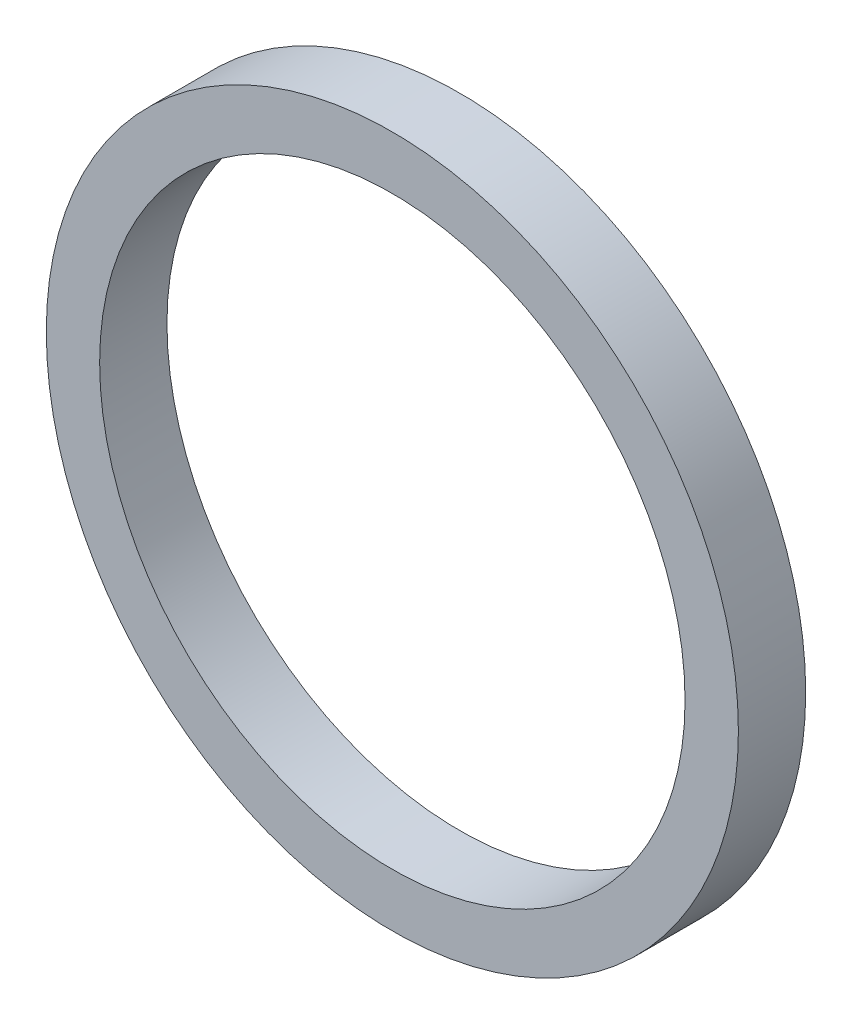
ISO-10303-21;
HEADER;
FILE_DESCRIPTION(('STEP AP214'),'2;1');
FILE_NAME('part.step','',(''),(''),'','','');
FILE_SCHEMA(('AUTOMOTIVE_DESIGN { 1 0 10303 214 1 1 1 1 }'));
ENDSEC;
DATA;
#1=APPLICATION_CONTEXT('core data for automotive mechanical design processes');
#2=APPLICATION_PROTOCOL_DEFINITION('international standard','automotive_design',2000,#1);
#3=PRODUCT_CONTEXT('',#1,'mechanical');
#4=PRODUCT('Part','Part','',(#3));
#5=PRODUCT_RELATED_PRODUCT_CATEGORY('part','',(#4));
#6=PRODUCT_DEFINITION_FORMATION('','',#4);
#7=PRODUCT_DEFINITION_CONTEXT('part definition',#1,'design');
#8=PRODUCT_DEFINITION('design','',#6,#7);
#9=PRODUCT_DEFINITION_SHAPE('','',#8);
#10=(LENGTH_UNIT() NAMED_UNIT(*) SI_UNIT(.MILLI.,.METRE.));
#11=(NAMED_UNIT(*) PLANE_ANGLE_UNIT() SI_UNIT($,.RADIAN.));
#12=(NAMED_UNIT(*) SI_UNIT($,.STERADIAN.) SOLID_ANGLE_UNIT());
#13=UNCERTAINTY_MEASURE_WITH_UNIT(LENGTH_MEASURE(1.E-05),#10,'distance_accuracy_value','');
#14=(GEOMETRIC_REPRESENTATION_CONTEXT(3) GLOBAL_UNCERTAINTY_ASSIGNED_CONTEXT((#13)) GLOBAL_UNIT_ASSIGNED_CONTEXT((#10,
#11,#12)) REPRESENTATION_CONTEXT('',''));
#15=CARTESIAN_POINT('',(0.,0.,0.));
#16=DIRECTION('',(0.,0.,1.));
#17=DIRECTION('',(1.,0.,0.));
#18=AXIS2_PLACEMENT_3D('',#15,#16,#17);
#19=CARTESIAN_POINT('',(0.,0.,3.571875));
#20=DIRECTION('',(0.,0.,1.));
#21=DIRECTION('',(1.,0.,0.));
#22=AXIS2_PLACEMENT_3D('',#19,#20,#21);
#23=CYLINDRICAL_SURFACE('',#22,8.60041208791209);
#24=CARTESIAN_POINT('',(0.,0.,-3.39328125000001));
#25=DIRECTION('',(0.,0.,1.));
#26=DIRECTION('',(1.,0.,0.));
#27=AXIS2_PLACEMENT_3D('',#24,#25,#26);
#28=CIRCLE('',#27,8.60041208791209);
#29=CARTESIAN_POINT('',(8.60041208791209,0.,-3.39328125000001));
#30=VERTEX_POINT('',#29);
#31=EDGE_CURVE('E11',#30,#30,#28,.T.);
#32=ORIENTED_EDGE('',*,*,#31,.T.);
#33=EDGE_LOOP('',(#32));
#34=FACE_BOUND('',#33,.T.);
#35=CARTESIAN_POINT('',(0.,0.,-1.72035132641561));
#36=DIRECTION('',(0.,0.,1.));
#37=DIRECTION('',(1.,0.,0.));
#38=AXIS2_PLACEMENT_3D('',#35,#36,#37);
#39=CIRCLE('',#38,8.60041208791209);
#40=CARTESIAN_POINT('',(8.60041208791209,0.,-1.72035132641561));
#41=VERTEX_POINT('',#40);
#42=EDGE_CURVE('E46',#41,#41,#39,.T.);
#43=ORIENTED_EDGE('',*,*,#42,.F.);
#44=EDGE_LOOP('',(#43));
#45=FACE_BOUND('',#44,.T.);
#46=ADVANCED_FACE('F17',(#34,#45),#23,.T.);
#47=CARTESIAN_POINT('',(0.,0.,3.571875));
#48=DIRECTION('',(0.,0.,1.));
#49=DIRECTION('',(1.,0.,0.));
#50=AXIS2_PLACEMENT_3D('',#47,#48,#49);
#51=CYLINDRICAL_SURFACE('',#50,7.27458791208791);
#52=CARTESIAN_POINT('',(0.,0.,-3.39328125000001));
#53=DIRECTION('',(0.,0.,1.));
#54=DIRECTION('',(1.,0.,0.));
#55=AXIS2_PLACEMENT_3D('',#52,#53,#54);
#56=CIRCLE('',#55,7.27458791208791);
#57=CARTESIAN_POINT('',(7.27458791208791,0.,-3.39328125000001));
#58=VERTEX_POINT('',#57);
#59=EDGE_CURVE('E26',#58,#58,#56,.T.);
#60=ORIENTED_EDGE('',*,*,#59,.F.);
#61=EDGE_LOOP('',(#60));
#62=FACE_BOUND('',#61,.T.);
#63=CARTESIAN_POINT('',(0.,0.,-1.72035132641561));
#64=DIRECTION('',(0.,0.,1.));
#65=DIRECTION('',(1.,0.,0.));
#66=AXIS2_PLACEMENT_3D('',#63,#64,#65);
#67=CIRCLE('',#66,7.27458791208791);
#68=CARTESIAN_POINT('',(7.27458791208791,0.,-1.72035132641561));
#69=VERTEX_POINT('',#68);
#70=EDGE_CURVE('E50',#69,#69,#67,.T.);
#71=ORIENTED_EDGE('',*,*,#70,.T.);
#72=EDGE_LOOP('',(#71));
#73=FACE_BOUND('',#72,.T.);
#74=ADVANCED_FACE('F61',(#62,#73),#51,.F.);
#75=CARTESIAN_POINT('',(0.,8.60041208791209,-3.39328125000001));
#76=DIRECTION('',(0.,0.,1.));
#77=DIRECTION('',(1.,0.,0.));
#78=AXIS2_PLACEMENT_3D('',#75,#76,#77);
#79=PLANE('',#78);
#80=ORIENTED_EDGE('',*,*,#31,.F.);
#81=EDGE_LOOP('',(#80));
#82=FACE_BOUND('',#81,.T.);
#83=ORIENTED_EDGE('',*,*,#59,.T.);
#84=EDGE_LOOP('',(#83));
#85=FACE_BOUND('',#84,.T.);
#86=ADVANCED_FACE('F59',(#82,#85),#79,.F.);
#87=CARTESIAN_POINT('',(0.,8.60041208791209,-1.72035132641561));
#88=DIRECTION('',(0.,0.,-1.));
#89=DIRECTION('',(0.,-1.,0.));
#90=AXIS2_PLACEMENT_3D('',#87,#88,#89);
#91=PLANE('',#90);
#92=ORIENTED_EDGE('',*,*,#70,.F.);
#93=EDGE_LOOP('',(#92));
#94=FACE_BOUND('',#93,.T.);
#95=ORIENTED_EDGE('',*,*,#42,.T.);
#96=EDGE_LOOP('',(#95));
#97=FACE_BOUND('',#96,.T.);
#98=ADVANCED_FACE('F47',(#94,#97),#91,.F.);
#99=CLOSED_SHELL('',(#46,#74,#86,#98));
#100=MANIFOLD_SOLID_BREP('B1',#99);
#101=ADVANCED_BREP_SHAPE_REPRESENTATION('',(#18,#100),#14);
#102=SHAPE_DEFINITION_REPRESENTATION(#9,#101);
ENDSEC;
END-ISO-10303-21;
